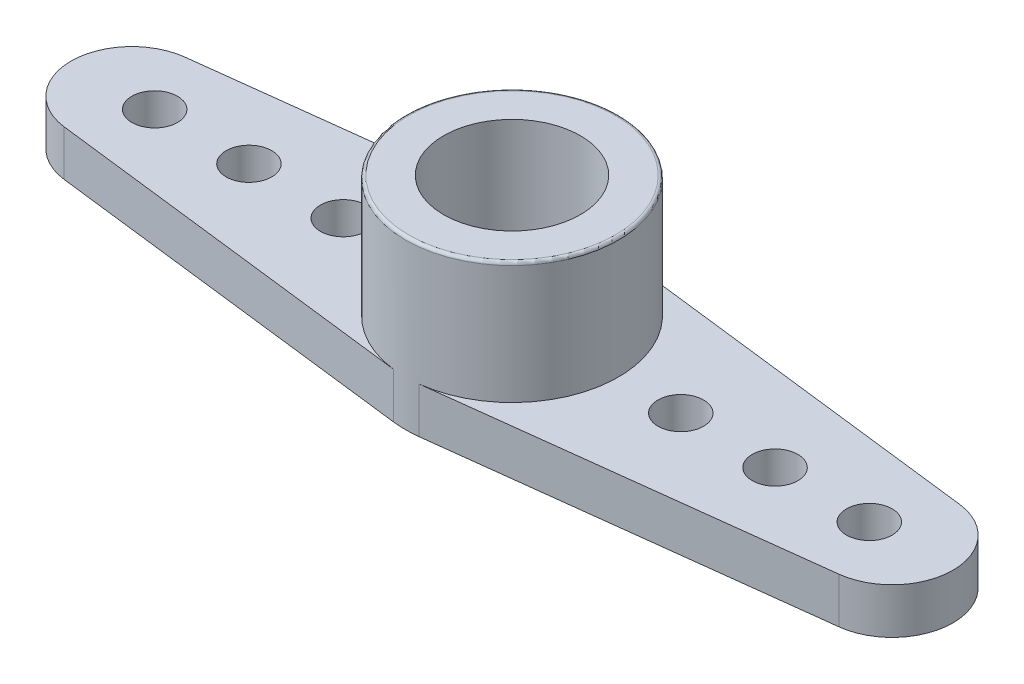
ISO-10303-21;
HEADER;
FILE_DESCRIPTION(('STEP AP214'),'2;1');
FILE_NAME('part.step','',(''),(''),'','','');
FILE_SCHEMA(('AUTOMOTIVE_DESIGN { 1 0 10303 214 1 1 1 1 }'));
ENDSEC;
DATA;
#1=APPLICATION_CONTEXT('core data for automotive mechanical design processes');
#2=APPLICATION_PROTOCOL_DEFINITION('international standard','automotive_design',2000,#1);
#3=PRODUCT_CONTEXT('',#1,'mechanical');
#4=PRODUCT('Part','Part','',(#3));
#5=PRODUCT_RELATED_PRODUCT_CATEGORY('part','',(#4));
#6=PRODUCT_DEFINITION_FORMATION('','',#4);
#7=PRODUCT_DEFINITION_CONTEXT('part definition',#1,'design');
#8=PRODUCT_DEFINITION('design','',#6,#7);
#9=PRODUCT_DEFINITION_SHAPE('','',#8);
#10=(LENGTH_UNIT() NAMED_UNIT(*) SI_UNIT(.MILLI.,.METRE.));
#11=(NAMED_UNIT(*) PLANE_ANGLE_UNIT() SI_UNIT($,.RADIAN.));
#12=(NAMED_UNIT(*) SI_UNIT($,.STERADIAN.) SOLID_ANGLE_UNIT());
#13=UNCERTAINTY_MEASURE_WITH_UNIT(LENGTH_MEASURE(1.E-05),#10,'distance_accuracy_value','');
#14=(GEOMETRIC_REPRESENTATION_CONTEXT(3) GLOBAL_UNCERTAINTY_ASSIGNED_CONTEXT((#13)) GLOBAL_UNIT_ASSIGNED_CONTEXT((#10,
#11,#12)) REPRESENTATION_CONTEXT('',''));
#15=CARTESIAN_POINT('',(0.,0.,0.));
#16=DIRECTION('',(0.,0.,1.));
#17=DIRECTION('',(1.,0.,0.));
#18=AXIS2_PLACEMENT_3D('',#15,#16,#17);
#19=CARTESIAN_POINT('',(0.,0.,0.));
#20=DIRECTION('',(0.,1.,0.));
#21=DIRECTION('',(0.,0.,1.));
#22=AXIS2_PLACEMENT_3D('',#19,#20,#21);
#23=PLANE('',#22);
#24=CARTESIAN_POINT('',(-5.55,0.,0.));
#25=DIRECTION('',(0.,1.,0.));
#26=DIRECTION('',(0.,0.,1.));
#27=AXIS2_PLACEMENT_3D('',#24,#25,#26);
#28=CIRCLE('',#27,0.75);
#29=CARTESIAN_POINT('',(-5.55,0.,0.750000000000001));
#30=VERTEX_POINT('',#29);
#31=EDGE_CURVE('E311',#30,#30,#28,.T.);
#32=ORIENTED_EDGE('',*,*,#31,.T.);
#33=EDGE_LOOP('',(#32));
#34=FACE_BOUND('',#33,.T.);
#35=CARTESIAN_POINT('',(-8.65,0.,0.));
#36=DIRECTION('',(0.,1.,0.));
#37=DIRECTION('',(0.,0.,1.));
#38=AXIS2_PLACEMENT_3D('',#35,#36,#37);
#39=CIRCLE('',#38,0.75);
#40=CARTESIAN_POINT('',(-8.65,0.,0.750000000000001));
#41=VERTEX_POINT('',#40);
#42=EDGE_CURVE('E313',#41,#41,#39,.T.);
#43=ORIENTED_EDGE('',*,*,#42,.T.);
#44=EDGE_LOOP('',(#43));
#45=FACE_BOUND('',#44,.T.);
#46=CARTESIAN_POINT('',(-11.75,0.,0.));
#47=DIRECTION('',(0.,1.,0.));
#48=DIRECTION('',(0.,0.,1.));
#49=AXIS2_PLACEMENT_3D('',#46,#47,#48);
#50=CIRCLE('',#49,0.75);
#51=CARTESIAN_POINT('',(-11.75,0.,0.750000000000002));
#52=VERTEX_POINT('',#51);
#53=EDGE_CURVE('E316',#52,#52,#50,.T.);
#54=ORIENTED_EDGE('',*,*,#53,.T.);
#55=EDGE_LOOP('',(#54));
#56=FACE_BOUND('',#55,.T.);
#57=DIRECTION('',(0.992773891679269,0.,-0.12));
#58=VECTOR('',#57,1.);
#59=CARTESIAN_POINT('',(-0.42,0.,-3.47470862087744));
#60=LINE('',#59,#58);
#61=CARTESIAN_POINT('',(-12.74,0.,-1.98554778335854));
#62=VERTEX_POINT('',#61);
#63=CARTESIAN_POINT('',(-0.42,0.,-3.47470862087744));
#64=VERTEX_POINT('',#63);
#65=EDGE_CURVE('E324',#62,#64,#60,.T.);
#66=ORIENTED_EDGE('',*,*,#65,.T.);
#67=CARTESIAN_POINT('',(0.,0.,0.));
#68=DIRECTION('',(0.,1.,0.));
#69=DIRECTION('',(0.,0.,1.));
#70=AXIS2_PLACEMENT_3D('',#67,#68,#69);
#71=CIRCLE('',#70,3.5);
#72=CARTESIAN_POINT('',(0.42,0.,-3.47470862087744));
#73=VERTEX_POINT('',#72);
#74=EDGE_CURVE('E322',#73,#64,#71,.T.);
#75=ORIENTED_EDGE('',*,*,#74,.F.);
#76=DIRECTION('',(-0.992773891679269,0.,-0.12));
#77=VECTOR('',#76,1.);
#78=CARTESIAN_POINT('',(0.42,0.,-3.47470862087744));
#79=LINE('',#78,#77);
#80=CARTESIAN_POINT('',(12.74,0.,-1.98554778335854));
#81=VERTEX_POINT('',#80);
#82=EDGE_CURVE('E343',#81,#73,#79,.T.);
#83=ORIENTED_EDGE('',*,*,#82,.F.);
#84=CARTESIAN_POINT('',(12.5,0.,0.));
#85=DIRECTION('',(0.,-1.,0.));
#86=DIRECTION('',(0.,0.,1.));
#87=AXIS2_PLACEMENT_3D('',#84,#85,#86);
#88=CIRCLE('',#87,2.);
#89=CARTESIAN_POINT('',(12.74,0.,1.98554778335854));
#90=VERTEX_POINT('',#89);
#91=EDGE_CURVE('E345',#81,#90,#88,.T.);
#92=ORIENTED_EDGE('',*,*,#91,.T.);
#93=DIRECTION('',(-0.992773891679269,0.,0.12));
#94=VECTOR('',#93,1.);
#95=CARTESIAN_POINT('',(0.42,0.,3.47470862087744));
#96=LINE('',#95,#94);
#97=CARTESIAN_POINT('',(0.419999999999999,0.,3.47470862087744));
#98=VERTEX_POINT('',#97);
#99=EDGE_CURVE('E347',#90,#98,#96,.T.);
#100=ORIENTED_EDGE('',*,*,#99,.T.);
#101=CARTESIAN_POINT('',(-0.419999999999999,0.,3.47470862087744));
#102=VERTEX_POINT('',#101);
#103=EDGE_CURVE('E58',#102,#98,#71,.T.);
#104=ORIENTED_EDGE('',*,*,#103,.F.);
#105=DIRECTION('',(0.992773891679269,0.,0.12));
#106=VECTOR('',#105,1.);
#107=CARTESIAN_POINT('',(-0.42,0.,3.47470862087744));
#108=LINE('',#107,#106);
#109=CARTESIAN_POINT('',(-12.74,0.,1.98554778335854));
#110=VERTEX_POINT('',#109);
#111=EDGE_CURVE('E319',#110,#102,#108,.T.);
#112=ORIENTED_EDGE('',*,*,#111,.F.);
#113=CARTESIAN_POINT('',(-12.5,0.,0.));
#114=DIRECTION('',(0.,1.,0.));
#115=DIRECTION('',(0.,0.,1.));
#116=AXIS2_PLACEMENT_3D('',#113,#114,#115);
#117=CIRCLE('',#116,2.);
#118=EDGE_CURVE('E327',#62,#110,#117,.T.);
#119=ORIENTED_EDGE('',*,*,#118,.F.);
#120=EDGE_LOOP('',(#66,#75,#83,#92,#100,#104,#112,#119));
#121=FACE_BOUND('',#120,.T.);
#122=CARTESIAN_POINT('',(11.75,0.,0.));
#123=DIRECTION('',(0.,-1.,0.));
#124=DIRECTION('',(0.,0.,1.));
#125=AXIS2_PLACEMENT_3D('',#122,#123,#124);
#126=CIRCLE('',#125,0.75);
#127=CARTESIAN_POINT('',(11.75,0.,0.750000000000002));
#128=VERTEX_POINT('',#127);
#129=EDGE_CURVE('E349',#128,#128,#126,.T.);
#130=ORIENTED_EDGE('',*,*,#129,.F.);
#131=EDGE_LOOP('',(#130));
#132=FACE_BOUND('',#131,.T.);
#133=CARTESIAN_POINT('',(8.65,0.,0.));
#134=DIRECTION('',(0.,-1.,0.));
#135=DIRECTION('',(0.,0.,1.));
#136=AXIS2_PLACEMENT_3D('',#133,#134,#135);
#137=CIRCLE('',#136,0.75);
#138=CARTESIAN_POINT('',(8.65,0.,0.750000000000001));
#139=VERTEX_POINT('',#138);
#140=EDGE_CURVE('E125',#139,#139,#137,.T.);
#141=ORIENTED_EDGE('',*,*,#140,.F.);
#142=EDGE_LOOP('',(#141));
#143=FACE_BOUND('',#142,.T.);
#144=CARTESIAN_POINT('',(5.55,0.,0.));
#145=DIRECTION('',(0.,-1.,0.));
#146=DIRECTION('',(0.,0.,1.));
#147=AXIS2_PLACEMENT_3D('',#144,#145,#146);
#148=CIRCLE('',#147,0.75);
#149=CARTESIAN_POINT('',(5.55,0.,0.750000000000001));
#150=VERTEX_POINT('',#149);
#151=EDGE_CURVE('E121',#150,#150,#148,.T.);
#152=ORIENTED_EDGE('',*,*,#151,.F.);
#153=EDGE_LOOP('',(#152));
#154=FACE_BOUND('',#153,.T.);
#155=CARTESIAN_POINT('',(0.,0.,0.));
#156=DIRECTION('',(0.,1.,0.));
#157=DIRECTION('',(0.,0.,1.));
#158=AXIS2_PLACEMENT_3D('',#155,#156,#157);
#159=CIRCLE('',#158,2.625);
#160=CARTESIAN_POINT('',(0.,0.,2.625));
#161=VERTEX_POINT('',#160);
#162=EDGE_CURVE('E146',#161,#161,#159,.F.);
#163=ORIENTED_EDGE('',*,*,#162,.F.);
#164=EDGE_LOOP('',(#163));
#165=FACE_BOUND('',#164,.T.);
#166=ADVANCED_FACE('F35',(#34,#45,#56,#121,#132,#143,#154,#165),#23,.F.);
#167=CARTESIAN_POINT('',(0.,1.5,0.));
#168=DIRECTION('',(0.,1.,0.));
#169=DIRECTION('',(0.,0.,1.));
#170=AXIS2_PLACEMENT_3D('',#167,#168,#169);
#171=PLANE('',#170);
#172=CARTESIAN_POINT('',(0.,1.5,0.));
#173=DIRECTION('',(0.,1.,0.));
#174=DIRECTION('',(0.,0.,1.));
#175=AXIS2_PLACEMENT_3D('',#172,#173,#174);
#176=CIRCLE('',#175,3.5);
#177=CARTESIAN_POINT('',(0.419999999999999,1.5,3.47470862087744));
#178=VERTEX_POINT('',#177);
#179=CARTESIAN_POINT('',(0.42,1.5,-3.47470862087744));
#180=VERTEX_POINT('',#179);
#181=EDGE_CURVE('E116',#178,#180,#176,.T.);
#182=ORIENTED_EDGE('',*,*,#181,.F.);
#183=DIRECTION('',(-0.992773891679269,0.,0.12));
#184=VECTOR('',#183,1.);
#185=CARTESIAN_POINT('',(0.42,1.5,3.47470862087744));
#186=LINE('',#185,#184);
#187=CARTESIAN_POINT('',(12.74,1.5,1.98554778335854));
#188=VERTEX_POINT('',#187);
#189=EDGE_CURVE('E102',#188,#178,#186,.T.);
#190=ORIENTED_EDGE('',*,*,#189,.F.);
#191=CARTESIAN_POINT('',(12.5,1.5,0.));
#192=DIRECTION('',(0.,-1.,0.));
#193=DIRECTION('',(0.,0.,1.));
#194=AXIS2_PLACEMENT_3D('',#191,#192,#193);
#195=CIRCLE('',#194,2.);
#196=CARTESIAN_POINT('',(12.74,1.5,-1.98554778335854));
#197=VERTEX_POINT('',#196);
#198=EDGE_CURVE('E109',#197,#188,#195,.T.);
#199=ORIENTED_EDGE('',*,*,#198,.F.);
#200=DIRECTION('',(-0.992773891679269,0.,-0.12));
#201=VECTOR('',#200,1.);
#202=CARTESIAN_POINT('',(0.42,1.5,-3.47470862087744));
#203=LINE('',#202,#201);
#204=EDGE_CURVE('E50',#197,#180,#203,.T.);
#205=ORIENTED_EDGE('',*,*,#204,.T.);
#206=EDGE_LOOP('',(#182,#190,#199,#205));
#207=FACE_BOUND('',#206,.T.);
#208=CARTESIAN_POINT('',(5.55,1.5,0.));
#209=DIRECTION('',(0.,-1.,0.));
#210=DIRECTION('',(0.,0.,1.));
#211=AXIS2_PLACEMENT_3D('',#208,#209,#210);
#212=CIRCLE('',#211,0.75);
#213=CARTESIAN_POINT('',(5.55,1.5,0.750000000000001));
#214=VERTEX_POINT('',#213);
#215=EDGE_CURVE('E133',#214,#214,#212,.T.);
#216=ORIENTED_EDGE('',*,*,#215,.T.);
#217=EDGE_LOOP('',(#216));
#218=FACE_BOUND('',#217,.T.);
#219=CARTESIAN_POINT('',(8.65,1.5,0.));
#220=DIRECTION('',(0.,-1.,0.));
#221=DIRECTION('',(0.,0.,1.));
#222=AXIS2_PLACEMENT_3D('',#219,#220,#221);
#223=CIRCLE('',#222,0.75);
#224=CARTESIAN_POINT('',(8.65,1.5,0.750000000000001));
#225=VERTEX_POINT('',#224);
#226=EDGE_CURVE('E625',#225,#225,#223,.T.);
#227=ORIENTED_EDGE('',*,*,#226,.T.);
#228=EDGE_LOOP('',(#227));
#229=FACE_BOUND('',#228,.T.);
#230=CARTESIAN_POINT('',(11.75,1.5,0.));
#231=DIRECTION('',(0.,-1.,0.));
#232=DIRECTION('',(0.,0.,1.));
#233=AXIS2_PLACEMENT_3D('',#230,#231,#232);
#234=CIRCLE('',#233,0.75);
#235=CARTESIAN_POINT('',(11.75,1.5,0.750000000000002));
#236=VERTEX_POINT('',#235);
#237=EDGE_CURVE('E110',#236,#236,#234,.T.);
#238=ORIENTED_EDGE('',*,*,#237,.T.);
#239=EDGE_LOOP('',(#238));
#240=FACE_BOUND('',#239,.T.);
#241=ADVANCED_FACE('F119',(#207,#218,#229,#240),#171,.T.);
#242=CARTESIAN_POINT('',(-0.42,1.5,3.47470862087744));
#243=DIRECTION('',(0.12,0.,-0.992773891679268));
#244=DIRECTION('',(-0.992773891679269,0.,-0.12));
#245=AXIS2_PLACEMENT_3D('',#242,#243,#244);
#246=PLANE('',#245);
#247=ORIENTED_EDGE('',*,*,#111,.T.);
#248=DIRECTION('',(0.,-1.,0.));
#249=VECTOR('',#248,1.);
#250=CARTESIAN_POINT('',(-0.419999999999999,1.5,3.47470862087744));
#251=LINE('',#250,#249);
#252=CARTESIAN_POINT('',(-0.419999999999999,1.5,3.47470862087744));
#253=VERTEX_POINT('',#252);
#254=EDGE_CURVE('E147',#253,#102,#251,.T.);
#255=ORIENTED_EDGE('',*,*,#254,.F.);
#256=DIRECTION('',(0.992773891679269,0.,0.12));
#257=VECTOR('',#256,1.);
#258=CARTESIAN_POINT('',(-0.42,1.5,3.47470862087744));
#259=LINE('',#258,#257);
#260=CARTESIAN_POINT('',(-12.74,1.5,1.98554778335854));
#261=VERTEX_POINT('',#260);
#262=EDGE_CURVE('E149',#261,#253,#259,.T.);
#263=ORIENTED_EDGE('',*,*,#262,.F.);
#264=DIRECTION('',(0.,-1.,0.));
#265=VECTOR('',#264,1.);
#266=CARTESIAN_POINT('',(-12.74,1.5,1.98554778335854));
#267=LINE('',#266,#265);
#268=EDGE_CURVE('E310',#261,#110,#267,.T.);
#269=ORIENTED_EDGE('',*,*,#268,.T.);
#270=EDGE_LOOP('',(#247,#255,#263,#269));
#271=FACE_BOUND('',#270,.T.);
#272=ADVANCED_FACE('F214',(#271),#246,.F.);
#273=CARTESIAN_POINT('',(0.,1.5,0.));
#274=DIRECTION('',(0.,-1.,0.));
#275=DIRECTION('',(0.,0.,-1.));
#276=AXIS2_PLACEMENT_3D('',#273,#274,#275);
#277=CYLINDRICAL_SURFACE('',#276,3.5);
#278=CARTESIAN_POINT('',(0.,5.4,0.));
#279=DIRECTION('',(0.,1.,0.));
#280=DIRECTION('',(0.,0.,1.));
#281=AXIS2_PLACEMENT_3D('',#278,#279,#280);
#282=CIRCLE('',#281,3.5);
#283=CARTESIAN_POINT('',(0.,5.4,3.5));
#284=VERTEX_POINT('',#283);
#285=EDGE_CURVE('E11',#284,#284,#282,.F.);
#286=ORIENTED_EDGE('',*,*,#285,.T.);
#287=EDGE_LOOP('',(#286));
#288=FACE_BOUND('',#287,.T.);
#289=DIRECTION('',(0.,-1.,0.));
#290=VECTOR('',#289,1.);
#291=CARTESIAN_POINT('',(-0.42,1.5,-3.47470862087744));
#292=LINE('',#291,#290);
#293=CARTESIAN_POINT('',(-0.42,1.5,-3.47470862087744));
#294=VERTEX_POINT('',#293);
#295=EDGE_CURVE('E156',#294,#64,#292,.T.);
#296=ORIENTED_EDGE('',*,*,#295,.F.);
#297=EDGE_CURVE('E142',#294,#253,#176,.T.);
#298=ORIENTED_EDGE('',*,*,#297,.T.);
#299=ORIENTED_EDGE('',*,*,#254,.T.);
#300=ORIENTED_EDGE('',*,*,#103,.T.);
#301=DIRECTION('',(0.,-1.,0.));
#302=VECTOR('',#301,1.);
#303=CARTESIAN_POINT('',(0.419999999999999,1.5,3.47470862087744));
#304=LINE('',#303,#302);
#305=EDGE_CURVE('E105',#178,#98,#304,.T.);
#306=ORIENTED_EDGE('',*,*,#305,.F.);
#307=ORIENTED_EDGE('',*,*,#181,.T.);
#308=DIRECTION('',(0.,-1.,0.));
#309=VECTOR('',#308,1.);
#310=CARTESIAN_POINT('',(0.42,1.5,-3.47470862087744));
#311=LINE('',#310,#309);
#312=EDGE_CURVE('E117',#180,#73,#311,.T.);
#313=ORIENTED_EDGE('',*,*,#312,.T.);
#314=ORIENTED_EDGE('',*,*,#74,.T.);
#315=EDGE_LOOP('',(#296,#298,#299,#300,#306,#307,#313,#314));
#316=FACE_BOUND('',#315,.T.);
#317=ADVANCED_FACE('F114',(#288,#316),#277,.T.);
#318=CARTESIAN_POINT('',(-0.42,1.5,-3.47470862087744));
#319=DIRECTION('',(-0.12,0.,-0.992773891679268));
#320=DIRECTION('',(-0.992773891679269,0.,0.12));
#321=AXIS2_PLACEMENT_3D('',#318,#319,#320);
#322=PLANE('',#321);
#323=ORIENTED_EDGE('',*,*,#65,.F.);
#324=DIRECTION('',(0.,-1.,0.));
#325=VECTOR('',#324,1.);
#326=CARTESIAN_POINT('',(-12.74,1.5,-1.98554778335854));
#327=LINE('',#326,#325);
#328=CARTESIAN_POINT('',(-12.74,1.5,-1.98554778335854));
#329=VERTEX_POINT('',#328);
#330=EDGE_CURVE('E137',#329,#62,#327,.T.);
#331=ORIENTED_EDGE('',*,*,#330,.F.);
#332=DIRECTION('',(0.992773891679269,0.,-0.12));
#333=VECTOR('',#332,1.);
#334=CARTESIAN_POINT('',(-0.42,1.5,-3.47470862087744));
#335=LINE('',#334,#333);
#336=EDGE_CURVE('E151',#329,#294,#335,.T.);
#337=ORIENTED_EDGE('',*,*,#336,.T.);
#338=ORIENTED_EDGE('',*,*,#295,.T.);
#339=EDGE_LOOP('',(#323,#331,#337,#338));
#340=FACE_BOUND('',#339,.T.);
#341=ADVANCED_FACE('F339',(#340),#322,.T.);
#342=CARTESIAN_POINT('',(-11.75,1.5,0.));
#343=DIRECTION('',(0.,-1.,0.));
#344=DIRECTION('',(0.,0.,-1.));
#345=AXIS2_PLACEMENT_3D('',#342,#343,#344);
#346=CYLINDRICAL_SURFACE('',#345,0.75);
#347=CARTESIAN_POINT('',(-11.75,1.5,0.));
#348=DIRECTION('',(0.,1.,0.));
#349=DIRECTION('',(0.,0.,1.));
#350=AXIS2_PLACEMENT_3D('',#347,#348,#349);
#351=CIRCLE('',#350,0.75);
#352=CARTESIAN_POINT('',(-11.75,1.5,0.750000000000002));
#353=VERTEX_POINT('',#352);
#354=EDGE_CURVE('E152',#353,#353,#351,.T.);
#355=ORIENTED_EDGE('',*,*,#354,.T.);
#356=EDGE_LOOP('',(#355));
#357=FACE_BOUND('',#356,.T.);
#358=ORIENTED_EDGE('',*,*,#53,.F.);
#359=EDGE_LOOP('',(#358));
#360=FACE_BOUND('',#359,.T.);
#361=ADVANCED_FACE('F363',(#357,#360),#346,.F.);
#362=CARTESIAN_POINT('',(-8.65,1.5,0.));
#363=DIRECTION('',(0.,-1.,0.));
#364=DIRECTION('',(0.,0.,-1.));
#365=AXIS2_PLACEMENT_3D('',#362,#363,#364);
#366=CYLINDRICAL_SURFACE('',#365,0.75);
#367=CARTESIAN_POINT('',(-8.65,1.5,0.));
#368=DIRECTION('',(0.,1.,0.));
#369=DIRECTION('',(0.,0.,1.));
#370=AXIS2_PLACEMENT_3D('',#367,#368,#369);
#371=CIRCLE('',#370,0.75);
#372=CARTESIAN_POINT('',(-8.65,1.5,0.750000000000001));
#373=VERTEX_POINT('',#372);
#374=EDGE_CURVE('E301',#373,#373,#371,.T.);
#375=ORIENTED_EDGE('',*,*,#374,.T.);
#376=EDGE_LOOP('',(#375));
#377=FACE_BOUND('',#376,.T.);
#378=ORIENTED_EDGE('',*,*,#42,.F.);
#379=EDGE_LOOP('',(#378));
#380=FACE_BOUND('',#379,.T.);
#381=ADVANCED_FACE('F357',(#377,#380),#366,.F.);
#382=CARTESIAN_POINT('',(-5.55,1.5,0.));
#383=DIRECTION('',(0.,-1.,0.));
#384=DIRECTION('',(0.,0.,-1.));
#385=AXIS2_PLACEMENT_3D('',#382,#383,#384);
#386=CYLINDRICAL_SURFACE('',#385,0.75);
#387=CARTESIAN_POINT('',(-5.55,1.5,0.));
#388=DIRECTION('',(0.,1.,0.));
#389=DIRECTION('',(0.,0.,1.));
#390=AXIS2_PLACEMENT_3D('',#387,#388,#389);
#391=CIRCLE('',#390,0.75);
#392=CARTESIAN_POINT('',(-5.55,1.5,0.750000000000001));
#393=VERTEX_POINT('',#392);
#394=EDGE_CURVE('E297',#393,#393,#391,.T.);
#395=ORIENTED_EDGE('',*,*,#394,.T.);
#396=EDGE_LOOP('',(#395));
#397=FACE_BOUND('',#396,.T.);
#398=ORIENTED_EDGE('',*,*,#31,.F.);
#399=EDGE_LOOP('',(#398));
#400=FACE_BOUND('',#399,.T.);
#401=ADVANCED_FACE('F290',(#397,#400),#386,.F.);
#402=CARTESIAN_POINT('',(-12.5,1.5,0.));
#403=DIRECTION('',(0.,-1.,0.));
#404=DIRECTION('',(0.,0.,-1.));
#405=AXIS2_PLACEMENT_3D('',#402,#403,#404);
#406=CYLINDRICAL_SURFACE('',#405,2.);
#407=ORIENTED_EDGE('',*,*,#118,.T.);
#408=ORIENTED_EDGE('',*,*,#268,.F.);
#409=CARTESIAN_POINT('',(-12.5,1.5,0.));
#410=DIRECTION('',(0.,1.,0.));
#411=DIRECTION('',(0.,0.,1.));
#412=AXIS2_PLACEMENT_3D('',#409,#410,#411);
#413=CIRCLE('',#412,2.);
#414=EDGE_CURVE('E165',#329,#261,#413,.T.);
#415=ORIENTED_EDGE('',*,*,#414,.F.);
#416=ORIENTED_EDGE('',*,*,#330,.T.);
#417=EDGE_LOOP('',(#407,#408,#415,#416));
#418=FACE_BOUND('',#417,.T.);
#419=ADVANCED_FACE('F285',(#418),#406,.T.);
#420=ORIENTED_EDGE('',*,*,#297,.F.);
#421=ORIENTED_EDGE('',*,*,#336,.F.);
#422=ORIENTED_EDGE('',*,*,#414,.T.);
#423=ORIENTED_EDGE('',*,*,#262,.T.);
#424=EDGE_LOOP('',(#420,#421,#422,#423));
#425=FACE_BOUND('',#424,.T.);
#426=ORIENTED_EDGE('',*,*,#394,.F.);
#427=EDGE_LOOP('',(#426));
#428=FACE_BOUND('',#427,.T.);
#429=ORIENTED_EDGE('',*,*,#374,.F.);
#430=EDGE_LOOP('',(#429));
#431=FACE_BOUND('',#430,.T.);
#432=ORIENTED_EDGE('',*,*,#354,.F.);
#433=EDGE_LOOP('',(#432));
#434=FACE_BOUND('',#433,.T.);
#435=ADVANCED_FACE('F217',(#425,#428,#431,#434),#171,.T.);
#436=CARTESIAN_POINT('',(0.42,1.5,3.47470862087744));
#437=DIRECTION('',(0.12,0.,0.992773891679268));
#438=DIRECTION('',(0.992773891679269,0.,-0.12));
#439=AXIS2_PLACEMENT_3D('',#436,#437,#438);
#440=PLANE('',#439);
#441=ORIENTED_EDGE('',*,*,#99,.F.);
#442=DIRECTION('',(0.,-1.,0.));
#443=VECTOR('',#442,1.);
#444=CARTESIAN_POINT('',(12.74,1.5,1.98554778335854));
#445=LINE('',#444,#443);
#446=EDGE_CURVE('E107',#188,#90,#445,.T.);
#447=ORIENTED_EDGE('',*,*,#446,.F.);
#448=ORIENTED_EDGE('',*,*,#189,.T.);
#449=ORIENTED_EDGE('',*,*,#305,.T.);
#450=EDGE_LOOP('',(#441,#447,#448,#449));
#451=FACE_BOUND('',#450,.T.);
#452=ADVANCED_FACE('F104',(#451),#440,.T.);
#453=CARTESIAN_POINT('',(12.5,1.5,0.));
#454=DIRECTION('',(0.,-1.,0.));
#455=DIRECTION('',(0.,0.,-1.));
#456=AXIS2_PLACEMENT_3D('',#453,#454,#455);
#457=CYLINDRICAL_SURFACE('',#456,2.);
#458=ORIENTED_EDGE('',*,*,#91,.F.);
#459=DIRECTION('',(0.,-1.,0.));
#460=VECTOR('',#459,1.);
#461=CARTESIAN_POINT('',(12.74,1.5,-1.98554778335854));
#462=LINE('',#461,#460);
#463=EDGE_CURVE('E172',#197,#81,#462,.T.);
#464=ORIENTED_EDGE('',*,*,#463,.F.);
#465=ORIENTED_EDGE('',*,*,#198,.T.);
#466=ORIENTED_EDGE('',*,*,#446,.T.);
#467=EDGE_LOOP('',(#458,#464,#465,#466));
#468=FACE_BOUND('',#467,.T.);
#469=ADVANCED_FACE('F268',(#468),#457,.T.);
#470=CARTESIAN_POINT('',(0.42,1.5,-3.47470862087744));
#471=DIRECTION('',(-0.12,0.,0.992773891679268));
#472=DIRECTION('',(0.992773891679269,0.,0.12));
#473=AXIS2_PLACEMENT_3D('',#470,#471,#472);
#474=PLANE('',#473);
#475=ORIENTED_EDGE('',*,*,#82,.T.);
#476=ORIENTED_EDGE('',*,*,#312,.F.);
#477=ORIENTED_EDGE('',*,*,#204,.F.);
#478=ORIENTED_EDGE('',*,*,#463,.T.);
#479=EDGE_LOOP('',(#475,#476,#477,#478));
#480=FACE_BOUND('',#479,.T.);
#481=ADVANCED_FACE('F264',(#480),#474,.F.);
#482=CARTESIAN_POINT('',(11.75,1.5,0.));
#483=DIRECTION('',(0.,-1.,0.));
#484=DIRECTION('',(0.,0.,-1.));
#485=AXIS2_PLACEMENT_3D('',#482,#483,#484);
#486=CYLINDRICAL_SURFACE('',#485,0.75);
#487=ORIENTED_EDGE('',*,*,#237,.F.);
#488=EDGE_LOOP('',(#487));
#489=FACE_BOUND('',#488,.T.);
#490=ORIENTED_EDGE('',*,*,#129,.T.);
#491=EDGE_LOOP('',(#490));
#492=FACE_BOUND('',#491,.T.);
#493=ADVANCED_FACE('F267',(#489,#492),#486,.F.);
#494=CARTESIAN_POINT('',(8.65,1.5,0.));
#495=DIRECTION('',(0.,-1.,0.));
#496=DIRECTION('',(0.,0.,-1.));
#497=AXIS2_PLACEMENT_3D('',#494,#495,#496);
#498=CYLINDRICAL_SURFACE('',#497,0.75);
#499=ORIENTED_EDGE('',*,*,#226,.F.);
#500=EDGE_LOOP('',(#499));
#501=FACE_BOUND('',#500,.T.);
#502=ORIENTED_EDGE('',*,*,#140,.T.);
#503=EDGE_LOOP('',(#502));
#504=FACE_BOUND('',#503,.T.);
#505=ADVANCED_FACE('F277',(#501,#504),#498,.F.);
#506=CARTESIAN_POINT('',(5.55,1.5,0.));
#507=DIRECTION('',(0.,-1.,0.));
#508=DIRECTION('',(0.,0.,-1.));
#509=AXIS2_PLACEMENT_3D('',#506,#507,#508);
#510=CYLINDRICAL_SURFACE('',#509,0.75);
#511=ORIENTED_EDGE('',*,*,#215,.F.);
#512=EDGE_LOOP('',(#511));
#513=FACE_BOUND('',#512,.T.);
#514=ORIENTED_EDGE('',*,*,#151,.T.);
#515=EDGE_LOOP('',(#514));
#516=FACE_BOUND('',#515,.T.);
#517=ADVANCED_FACE('F260',(#513,#516),#510,.F.);
#518=CARTESIAN_POINT('',(0.,5.5,0.));
#519=DIRECTION('',(0.,1.,0.));
#520=DIRECTION('',(0.,0.,1.));
#521=AXIS2_PLACEMENT_3D('',#518,#519,#520);
#522=PLANE('',#521);
#523=CARTESIAN_POINT('',(0.,5.5,0.));
#524=DIRECTION('',(0.,1.,0.));
#525=DIRECTION('',(0.,0.,1.));
#526=AXIS2_PLACEMENT_3D('',#523,#524,#525);
#527=CIRCLE('',#526,3.4);
#528=CARTESIAN_POINT('',(0.,5.5,3.4));
#529=VERTEX_POINT('',#528);
#530=EDGE_CURVE('E43',#529,#529,#527,.T.);
#531=ORIENTED_EDGE('',*,*,#530,.T.);
#532=EDGE_LOOP('',(#531));
#533=FACE_BOUND('',#532,.T.);
#534=CARTESIAN_POINT('',(0.,5.5,0.));
#535=DIRECTION('',(0.,1.,0.));
#536=DIRECTION('',(0.,0.,1.));
#537=AXIS2_PLACEMENT_3D('',#534,#535,#536);
#538=CIRCLE('',#537,2.25);
#539=CARTESIAN_POINT('',(0.,5.5,2.25));
#540=VERTEX_POINT('',#539);
#541=EDGE_CURVE('E122',#540,#540,#538,.T.);
#542=ORIENTED_EDGE('',*,*,#541,.F.);
#543=EDGE_LOOP('',(#542));
#544=FACE_BOUND('',#543,.T.);
#545=ADVANCED_FACE('F190',(#533,#544),#522,.T.);
#546=CARTESIAN_POINT('',(0.,5.5,0.));
#547=DIRECTION('',(0.,-1.,0.));
#548=DIRECTION('',(0.,0.,-1.));
#549=AXIS2_PLACEMENT_3D('',#546,#547,#548);
#550=CYLINDRICAL_SURFACE('',#549,2.25);
#551=ORIENTED_EDGE('',*,*,#541,.T.);
#552=EDGE_LOOP('',(#551));
#553=FACE_BOUND('',#552,.T.);
#554=CARTESIAN_POINT('',(0.,1.5,0.));
#555=DIRECTION('',(0.,1.,0.));
#556=DIRECTION('',(0.,0.,1.));
#557=AXIS2_PLACEMENT_3D('',#554,#555,#556);
#558=CIRCLE('',#557,2.25);
#559=CARTESIAN_POINT('',(0.,1.5,2.25));
#560=VERTEX_POINT('',#559);
#561=EDGE_CURVE('E128',#560,#560,#558,.T.);
#562=ORIENTED_EDGE('',*,*,#561,.F.);
#563=EDGE_LOOP('',(#562));
#564=FACE_BOUND('',#563,.T.);
#565=ADVANCED_FACE('F250',(#553,#564),#550,.F.);
#566=CARTESIAN_POINT('',(0.,1.5,0.));
#567=DIRECTION('',(0.,1.,0.));
#568=DIRECTION('',(0.,0.,1.));
#569=AXIS2_PLACEMENT_3D('',#566,#567,#568);
#570=CIRCLE('',#569,1.);
#571=CARTESIAN_POINT('',(0.,1.5,1.));
#572=VERTEX_POINT('',#571);
#573=EDGE_CURVE('E186',#572,#572,#570,.T.);
#574=ORIENTED_EDGE('',*,*,#573,.F.);
#575=EDGE_LOOP('',(#574));
#576=FACE_BOUND('',#575,.T.);
#577=ORIENTED_EDGE('',*,*,#561,.T.);
#578=EDGE_LOOP('',(#577));
#579=FACE_BOUND('',#578,.T.);
#580=ADVANCED_FACE('F216',(#576,#579),#171,.T.);
#581=CARTESIAN_POINT('',(0.,-0.2,0.));
#582=DIRECTION('',(0.,1.,0.));
#583=DIRECTION('',(0.,0.,1.));
#584=AXIS2_PLACEMENT_3D('',#581,#582,#583);
#585=CYLINDRICAL_SURFACE('',#584,2.625);
#586=CARTESIAN_POINT('',(0.,-0.1,0.));
#587=DIRECTION('',(0.,-1.,0.));
#588=DIRECTION('',(0.,0.,-1.));
#589=AXIS2_PLACEMENT_3D('',#586,#587,#588);
#590=CIRCLE('',#589,2.625);
#591=CARTESIAN_POINT('',(0.,-0.1,-2.625));
#592=VERTEX_POINT('',#591);
#593=EDGE_CURVE('E180',#592,#592,#590,.F.);
#594=ORIENTED_EDGE('',*,*,#593,.T.);
#595=EDGE_LOOP('',(#594));
#596=FACE_BOUND('',#595,.T.);
#597=ORIENTED_EDGE('',*,*,#162,.T.);
#598=EDGE_LOOP('',(#597));
#599=FACE_BOUND('',#598,.T.);
#600=ADVANCED_FACE('F231',(#596,#599),#585,.T.);
#601=CARTESIAN_POINT('',(0.,-0.2,0.));
#602=DIRECTION('',(0.,1.,0.));
#603=DIRECTION('',(0.,0.,1.));
#604=AXIS2_PLACEMENT_3D('',#601,#602,#603);
#605=CYLINDRICAL_SURFACE('',#604,2.425);
#606=CARTESIAN_POINT('',(0.,-0.1,0.));
#607=DIRECTION('',(0.,-1.,0.));
#608=DIRECTION('',(0.,0.,-1.));
#609=AXIS2_PLACEMENT_3D('',#606,#607,#608);
#610=CIRCLE('',#609,2.425);
#611=CARTESIAN_POINT('',(0.,-0.1,-2.425));
#612=VERTEX_POINT('',#611);
#613=EDGE_CURVE('E177',#612,#612,#610,.T.);
#614=ORIENTED_EDGE('',*,*,#613,.T.);
#615=EDGE_LOOP('',(#614));
#616=FACE_BOUND('',#615,.T.);
#617=CARTESIAN_POINT('',(0.,0.,0.));
#618=DIRECTION('',(0.,-1.,0.));
#619=DIRECTION('',(0.,0.,-1.));
#620=AXIS2_PLACEMENT_3D('',#617,#618,#619);
#621=CIRCLE('',#620,2.425);
#622=CARTESIAN_POINT('',(0.,0.,-2.425));
#623=VERTEX_POINT('',#622);
#624=EDGE_CURVE('E185',#623,#623,#621,.T.);
#625=ORIENTED_EDGE('',*,*,#624,.F.);
#626=EDGE_LOOP('',(#625));
#627=FACE_BOUND('',#626,.T.);
#628=ADVANCED_FACE('F222',(#616,#627),#605,.F.);
#629=CARTESIAN_POINT('',(0.,0.,0.));
#630=DIRECTION('',(0.,-1.,0.));
#631=DIRECTION('',(0.,0.,-1.));
#632=AXIS2_PLACEMENT_3D('',#629,#630,#631);
#633=CIRCLE('',#632,1.);
#634=CARTESIAN_POINT('',(0.,0.,-1.));
#635=VERTEX_POINT('',#634);
#636=EDGE_CURVE('E237',#635,#635,#633,.T.);
#637=ORIENTED_EDGE('',*,*,#636,.F.);
#638=EDGE_LOOP('',(#637));
#639=FACE_BOUND('',#638,.T.);
#640=ORIENTED_EDGE('',*,*,#624,.T.);
#641=EDGE_LOOP('',(#640));
#642=FACE_BOUND('',#641,.T.);
#643=ADVANCED_FACE('F210',(#639,#642),#23,.F.);
#644=CARTESIAN_POINT('',(0.,-0.1,0.));
#645=DIRECTION('',(0.,-1.,0.));
#646=DIRECTION('',(0.,0.,-1.));
#647=AXIS2_PLACEMENT_3D('',#644,#645,#646);
#648=TOROIDAL_SURFACE('',#647,2.525,0.1);
#649=ORIENTED_EDGE('',*,*,#593,.F.);
#650=EDGE_LOOP('',(#649));
#651=FACE_BOUND('',#650,.T.);
#652=CARTESIAN_POINT('',(0.,-0.2,0.));
#653=DIRECTION('',(0.,-1.,0.));
#654=DIRECTION('',(0.,0.,-1.));
#655=AXIS2_PLACEMENT_3D('',#652,#653,#654);
#656=CIRCLE('',#655,2.525);
#657=CARTESIAN_POINT('',(0.,-0.2,-2.525));
#658=VERTEX_POINT('',#657);
#659=EDGE_CURVE('E183',#658,#658,#656,.T.);
#660=ORIENTED_EDGE('',*,*,#659,.F.);
#661=EDGE_LOOP('',(#660));
#662=FACE_BOUND('',#661,.T.);
#663=ADVANCED_FACE('F203',(#651,#662),#648,.T.);
#664=CARTESIAN_POINT('',(0.,-0.1,0.));
#665=DIRECTION('',(0.,-1.,0.));
#666=DIRECTION('',(0.,0.,-1.));
#667=AXIS2_PLACEMENT_3D('',#664,#665,#666);
#668=TOROIDAL_SURFACE('',#667,2.525,0.1);
#669=ORIENTED_EDGE('',*,*,#659,.T.);
#670=EDGE_LOOP('',(#669));
#671=FACE_BOUND('',#670,.T.);
#672=ORIENTED_EDGE('',*,*,#613,.F.);
#673=EDGE_LOOP('',(#672));
#674=FACE_BOUND('',#673,.T.);
#675=ADVANCED_FACE('F195',(#671,#674),#668,.T.);
#676=CARTESIAN_POINT('',(0.,5.4,0.));
#677=DIRECTION('',(0.,1.,0.));
#678=DIRECTION('',(0.,0.,1.));
#679=AXIS2_PLACEMENT_3D('',#676,#677,#678);
#680=TOROIDAL_SURFACE('',#679,3.4,0.1);
#681=ORIENTED_EDGE('',*,*,#285,.F.);
#682=EDGE_LOOP('',(#681));
#683=FACE_BOUND('',#682,.T.);
#684=ORIENTED_EDGE('',*,*,#530,.F.);
#685=EDGE_LOOP('',(#684));
#686=FACE_BOUND('',#685,.T.);
#687=ADVANCED_FACE('F37',(#683,#686),#680,.T.);
#688=CARTESIAN_POINT('',(0.,5.5,0.));
#689=DIRECTION('',(0.,-1.,0.));
#690=DIRECTION('',(0.,0.,-1.));
#691=AXIS2_PLACEMENT_3D('',#688,#689,#690);
#692=CYLINDRICAL_SURFACE('',#691,1.);
#693=ORIENTED_EDGE('',*,*,#573,.T.);
#694=EDGE_LOOP('',(#693));
#695=FACE_BOUND('',#694,.T.);
#696=ORIENTED_EDGE('',*,*,#636,.T.);
#697=EDGE_LOOP('',(#696));
#698=FACE_BOUND('',#697,.T.);
#699=ADVANCED_FACE('F194',(#695,#698),#692,.F.);
#700=CLOSED_SHELL('',(#166,#241,#272,#317,#341,#361,#381,#401,#419,#435,#452,#469,#481,#493,
#505,#517,#545,#565,#580,#600,#628,#643,#663,#675,#687,#699));
#701=MANIFOLD_SOLID_BREP('B2',#700);
#702=ADVANCED_BREP_SHAPE_REPRESENTATION('',(#18,#701),#14);
#703=SHAPE_DEFINITION_REPRESENTATION(#9,#702);
ENDSEC;
END-ISO-10303-21;
